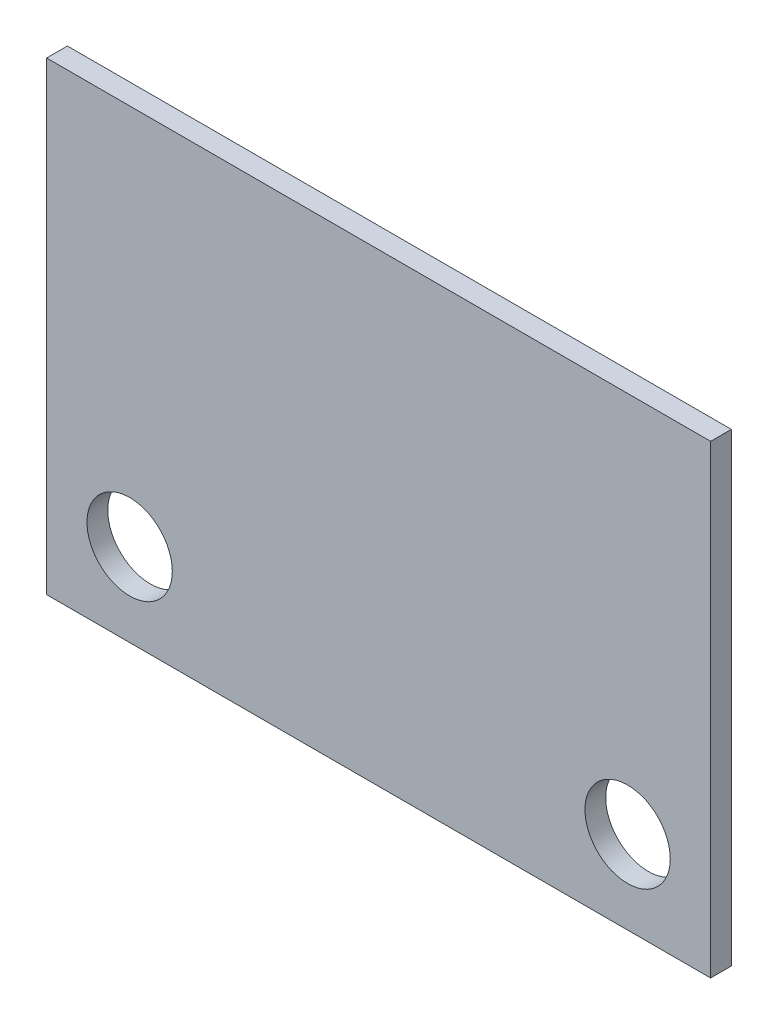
ISO-10303-21;
HEADER;
FILE_DESCRIPTION(('STEP AP214'),'2;1');
FILE_NAME('part.step','',(''),(''),'','','');
FILE_SCHEMA(('AUTOMOTIVE_DESIGN { 1 0 10303 214 1 1 1 1 }'));
ENDSEC;
DATA;
#1=APPLICATION_CONTEXT('core data for automotive mechanical design processes');
#2=APPLICATION_PROTOCOL_DEFINITION('international standard','automotive_design',2000,#1);
#3=PRODUCT_CONTEXT('',#1,'mechanical');
#4=PRODUCT('Part','Part','',(#3));
#5=PRODUCT_RELATED_PRODUCT_CATEGORY('part','',(#4));
#6=PRODUCT_DEFINITION_FORMATION('','',#4);
#7=PRODUCT_DEFINITION_CONTEXT('part definition',#1,'design');
#8=PRODUCT_DEFINITION('design','',#6,#7);
#9=PRODUCT_DEFINITION_SHAPE('','',#8);
#10=(LENGTH_UNIT() NAMED_UNIT(*) SI_UNIT(.MILLI.,.METRE.));
#11=(NAMED_UNIT(*) PLANE_ANGLE_UNIT() SI_UNIT($,.RADIAN.));
#12=(NAMED_UNIT(*) SI_UNIT($,.STERADIAN.) SOLID_ANGLE_UNIT());
#13=UNCERTAINTY_MEASURE_WITH_UNIT(LENGTH_MEASURE(1.E-05),#10,'distance_accuracy_value','');
#14=(GEOMETRIC_REPRESENTATION_CONTEXT(3) GLOBAL_UNCERTAINTY_ASSIGNED_CONTEXT((#13)) GLOBAL_UNIT_ASSIGNED_CONTEXT((#10,
#11,#12)) REPRESENTATION_CONTEXT('',''));
#15=CARTESIAN_POINT('',(0.,0.,0.));
#16=DIRECTION('',(0.,0.,1.));
#17=DIRECTION('',(1.,0.,0.));
#18=AXIS2_PLACEMENT_3D('',#15,#16,#17);
#19=CARTESIAN_POINT('',(-12.7,17.78,0.79375));
#20=DIRECTION('',(1.,0.,0.));
#21=DIRECTION('',(0.,0.,-1.));
#22=AXIS2_PLACEMENT_3D('',#19,#20,#21);
#23=PLANE('',#22);
#24=DIRECTION('',(0.,-1.,0.));
#25=VECTOR('',#24,1.);
#26=CARTESIAN_POINT('',(-12.7,17.78,0.));
#27=LINE('',#26,#25);
#28=CARTESIAN_POINT('',(-12.7,17.78,0.));
#29=VERTEX_POINT('',#28);
#30=CARTESIAN_POINT('',(-12.7,0.,0.));
#31=VERTEX_POINT('',#30);
#32=EDGE_CURVE('E70',#29,#31,#27,.T.);
#33=ORIENTED_EDGE('',*,*,#32,.T.);
#34=DIRECTION('',(0.,0.,-1.));
#35=VECTOR('',#34,1.);
#36=CARTESIAN_POINT('',(-12.7,0.,0.79375));
#37=LINE('',#36,#35);
#38=CARTESIAN_POINT('',(-12.7,0.,0.79375));
#39=VERTEX_POINT('',#38);
#40=EDGE_CURVE('E11',#39,#31,#37,.T.);
#41=ORIENTED_EDGE('',*,*,#40,.F.);
#42=DIRECTION('',(0.,-1.,0.));
#43=VECTOR('',#42,1.);
#44=CARTESIAN_POINT('',(-12.7,17.78,0.79375));
#45=LINE('',#44,#43);
#46=CARTESIAN_POINT('',(-12.7,17.78,0.79375));
#47=VERTEX_POINT('',#46);
#48=EDGE_CURVE('E93',#47,#39,#45,.T.);
#49=ORIENTED_EDGE('',*,*,#48,.F.);
#50=DIRECTION('',(0.,0.,-1.));
#51=VECTOR('',#50,1.);
#52=CARTESIAN_POINT('',(-12.7,17.78,0.79375));
#53=LINE('',#52,#51);
#54=EDGE_CURVE('E82',#47,#29,#53,.T.);
#55=ORIENTED_EDGE('',*,*,#54,.T.);
#56=EDGE_LOOP('',(#33,#41,#49,#55));
#57=FACE_BOUND('',#56,.T.);
#58=ADVANCED_FACE('F26',(#57),#23,.F.);
#59=CARTESIAN_POINT('',(-12.7,0.,0.79375));
#60=DIRECTION('',(0.,1.,0.));
#61=DIRECTION('',(-1.,0.,0.));
#62=AXIS2_PLACEMENT_3D('',#59,#60,#61);
#63=PLANE('',#62);
#64=DIRECTION('',(1.,0.,0.));
#65=VECTOR('',#64,1.);
#66=CARTESIAN_POINT('',(-12.7,0.,0.));
#67=LINE('',#66,#65);
#68=CARTESIAN_POINT('',(12.7,0.,0.));
#69=VERTEX_POINT('',#68);
#70=EDGE_CURVE('E66',#31,#69,#67,.T.);
#71=ORIENTED_EDGE('',*,*,#70,.T.);
#72=DIRECTION('',(0.,0.,-1.));
#73=VECTOR('',#72,1.);
#74=CARTESIAN_POINT('',(12.7,0.,0.79375));
#75=LINE('',#74,#73);
#76=CARTESIAN_POINT('',(12.7,0.,0.79375));
#77=VERTEX_POINT('',#76);
#78=EDGE_CURVE('E33',#77,#69,#75,.T.);
#79=ORIENTED_EDGE('',*,*,#78,.F.);
#80=DIRECTION('',(1.,0.,0.));
#81=VECTOR('',#80,1.);
#82=CARTESIAN_POINT('',(-12.7,0.,0.79375));
#83=LINE('',#82,#81);
#84=EDGE_CURVE('E78',#39,#77,#83,.T.);
#85=ORIENTED_EDGE('',*,*,#84,.F.);
#86=ORIENTED_EDGE('',*,*,#40,.T.);
#87=EDGE_LOOP('',(#71,#79,#85,#86));
#88=FACE_BOUND('',#87,.T.);
#89=ADVANCED_FACE('F77',(#88),#63,.F.);
#90=CARTESIAN_POINT('',(12.7,17.78,0.79375));
#91=DIRECTION('',(-1.,0.,0.));
#92=DIRECTION('',(0.,-1.,0.));
#93=AXIS2_PLACEMENT_3D('',#90,#91,#92);
#94=PLANE('',#93);
#95=DIRECTION('',(0.,1.,0.));
#96=VECTOR('',#95,1.);
#97=CARTESIAN_POINT('',(12.7,17.78,0.));
#98=LINE('',#97,#96);
#99=CARTESIAN_POINT('',(12.7,17.78,0.));
#100=VERTEX_POINT('',#99);
#101=EDGE_CURVE('E71',#69,#100,#98,.T.);
#102=ORIENTED_EDGE('',*,*,#101,.T.);
#103=DIRECTION('',(0.,0.,-1.));
#104=VECTOR('',#103,1.);
#105=CARTESIAN_POINT('',(12.7,17.78,0.79375));
#106=LINE('',#105,#104);
#107=CARTESIAN_POINT('',(12.7,17.78,0.79375));
#108=VERTEX_POINT('',#107);
#109=EDGE_CURVE('E99',#108,#100,#106,.T.);
#110=ORIENTED_EDGE('',*,*,#109,.F.);
#111=DIRECTION('',(0.,1.,0.));
#112=VECTOR('',#111,1.);
#113=CARTESIAN_POINT('',(12.7,17.78,0.79375));
#114=LINE('',#113,#112);
#115=EDGE_CURVE('E45',#77,#108,#114,.T.);
#116=ORIENTED_EDGE('',*,*,#115,.F.);
#117=ORIENTED_EDGE('',*,*,#78,.T.);
#118=EDGE_LOOP('',(#102,#110,#116,#117));
#119=FACE_BOUND('',#118,.T.);
#120=ADVANCED_FACE('F102',(#119),#94,.F.);
#121=CARTESIAN_POINT('',(-12.7,17.78,0.79375));
#122=DIRECTION('',(0.,-1.,0.));
#123=DIRECTION('',(1.,0.,0.));
#124=AXIS2_PLACEMENT_3D('',#121,#122,#123);
#125=PLANE('',#124);
#126=DIRECTION('',(-1.,0.,0.));
#127=VECTOR('',#126,1.);
#128=CARTESIAN_POINT('',(-12.7,17.78,0.));
#129=LINE('',#128,#127);
#130=EDGE_CURVE('E91',#100,#29,#129,.T.);
#131=ORIENTED_EDGE('',*,*,#130,.T.);
#132=ORIENTED_EDGE('',*,*,#54,.F.);
#133=DIRECTION('',(-1.,0.,0.));
#134=VECTOR('',#133,1.);
#135=CARTESIAN_POINT('',(-12.7,17.78,0.79375));
#136=LINE('',#135,#134);
#137=EDGE_CURVE('E40',#108,#47,#136,.T.);
#138=ORIENTED_EDGE('',*,*,#137,.F.);
#139=ORIENTED_EDGE('',*,*,#109,.T.);
#140=EDGE_LOOP('',(#131,#132,#138,#139));
#141=FACE_BOUND('',#140,.T.);
#142=ADVANCED_FACE('F104',(#141),#125,.F.);
#143=CARTESIAN_POINT('',(-12.7,17.78,0.79375));
#144=DIRECTION('',(0.,0.,1.));
#145=DIRECTION('',(1.,0.,0.));
#146=AXIS2_PLACEMENT_3D('',#143,#144,#145);
#147=PLANE('',#146);
#148=CARTESIAN_POINT('',(-9.525,3.17499999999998,0.793750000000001));
#149=DIRECTION('',(0.,0.,1.));
#150=DIRECTION('',(1.,0.,0.));
#151=AXIS2_PLACEMENT_3D('',#148,#149,#150);
#152=CIRCLE('',#151,1.63194999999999);
#153=CARTESIAN_POINT('',(-7.89305000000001,3.17499999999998,0.793750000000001));
#154=VERTEX_POINT('',#153);
#155=EDGE_CURVE('E161',#154,#154,#152,.T.);
#156=ORIENTED_EDGE('',*,*,#155,.F.);
#157=EDGE_LOOP('',(#156));
#158=FACE_BOUND('',#157,.T.);
#159=CARTESIAN_POINT('',(9.52500000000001,3.17499999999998,0.79375));
#160=DIRECTION('',(0.,0.,1.));
#161=DIRECTION('',(1.,0.,0.));
#162=AXIS2_PLACEMENT_3D('',#159,#160,#161);
#163=CIRCLE('',#162,1.63194999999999);
#164=CARTESIAN_POINT('',(11.15695,3.17499999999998,0.79375));
#165=VERTEX_POINT('',#164);
#166=EDGE_CURVE('E86',#165,#165,#163,.T.);
#167=ORIENTED_EDGE('',*,*,#166,.F.);
#168=EDGE_LOOP('',(#167));
#169=FACE_BOUND('',#168,.T.);
#170=ORIENTED_EDGE('',*,*,#48,.T.);
#171=ORIENTED_EDGE('',*,*,#84,.T.);
#172=ORIENTED_EDGE('',*,*,#115,.T.);
#173=ORIENTED_EDGE('',*,*,#137,.T.);
#174=EDGE_LOOP('',(#170,#171,#172,#173));
#175=FACE_BOUND('',#174,.T.);
#176=ADVANCED_FACE('F105',(#158,#169,#175),#147,.T.);
#177=CARTESIAN_POINT('',(-12.7,17.78,0.));
#178=DIRECTION('',(0.,0.,1.));
#179=DIRECTION('',(1.,0.,0.));
#180=AXIS2_PLACEMENT_3D('',#177,#178,#179);
#181=PLANE('',#180);
#182=CARTESIAN_POINT('',(-9.525,3.17499999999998,0.));
#183=DIRECTION('',(0.,0.,1.));
#184=DIRECTION('',(1.,0.,0.));
#185=AXIS2_PLACEMENT_3D('',#182,#183,#184);
#186=CIRCLE('',#185,1.63195);
#187=CARTESIAN_POINT('',(-7.89305,3.17499999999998,0.));
#188=VERTEX_POINT('',#187);
#189=EDGE_CURVE('E159',#188,#188,#186,.T.);
#190=ORIENTED_EDGE('',*,*,#189,.T.);
#191=EDGE_LOOP('',(#190));
#192=FACE_BOUND('',#191,.T.);
#193=CARTESIAN_POINT('',(9.52500000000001,3.17499999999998,0.));
#194=DIRECTION('',(0.,0.,1.));
#195=DIRECTION('',(1.,0.,0.));
#196=AXIS2_PLACEMENT_3D('',#193,#194,#195);
#197=CIRCLE('',#196,1.63195);
#198=CARTESIAN_POINT('',(11.15695,3.17499999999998,0.));
#199=VERTEX_POINT('',#198);
#200=EDGE_CURVE('E83',#199,#199,#197,.T.);
#201=ORIENTED_EDGE('',*,*,#200,.T.);
#202=EDGE_LOOP('',(#201));
#203=FACE_BOUND('',#202,.T.);
#204=ORIENTED_EDGE('',*,*,#32,.F.);
#205=ORIENTED_EDGE('',*,*,#130,.F.);
#206=ORIENTED_EDGE('',*,*,#101,.F.);
#207=ORIENTED_EDGE('',*,*,#70,.F.);
#208=EDGE_LOOP('',(#204,#205,#206,#207));
#209=FACE_BOUND('',#208,.T.);
#210=ADVANCED_FACE('F67',(#192,#203,#209),#181,.F.);
#211=CARTESIAN_POINT('',(9.52500000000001,3.17499999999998,0.793749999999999));
#212=DIRECTION('',(0.,0.,1.));
#213=DIRECTION('',(1.,0.,0.));
#214=AXIS2_PLACEMENT_3D('',#211,#212,#213);
#215=CYLINDRICAL_SURFACE('',#214,1.63194999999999);
#216=ORIENTED_EDGE('',*,*,#200,.F.);
#217=EDGE_LOOP('',(#216));
#218=FACE_BOUND('',#217,.T.);
#219=ORIENTED_EDGE('',*,*,#166,.T.);
#220=EDGE_LOOP('',(#219));
#221=FACE_BOUND('',#220,.T.);
#222=ADVANCED_FACE('F113',(#218,#221),#215,.F.);
#223=CARTESIAN_POINT('',(-9.525,3.17499999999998,0.793749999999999));
#224=DIRECTION('',(0.,0.,1.));
#225=DIRECTION('',(1.,0.,0.));
#226=AXIS2_PLACEMENT_3D('',#223,#224,#225);
#227=CYLINDRICAL_SURFACE('',#226,1.63194999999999);
#228=ORIENTED_EDGE('',*,*,#189,.F.);
#229=EDGE_LOOP('',(#228));
#230=FACE_BOUND('',#229,.T.);
#231=ORIENTED_EDGE('',*,*,#155,.T.);
#232=EDGE_LOOP('',(#231));
#233=FACE_BOUND('',#232,.T.);
#234=ADVANCED_FACE('F146',(#230,#233),#227,.F.);
#235=CLOSED_SHELL('',(#58,#89,#120,#142,#176,#210,#222,#234));
#236=MANIFOLD_SOLID_BREP('B2',#235);
#237=ADVANCED_BREP_SHAPE_REPRESENTATION('',(#18,#236),#14);
#238=SHAPE_DEFINITION_REPRESENTATION(#9,#237);
ENDSEC;
END-ISO-10303-21;
